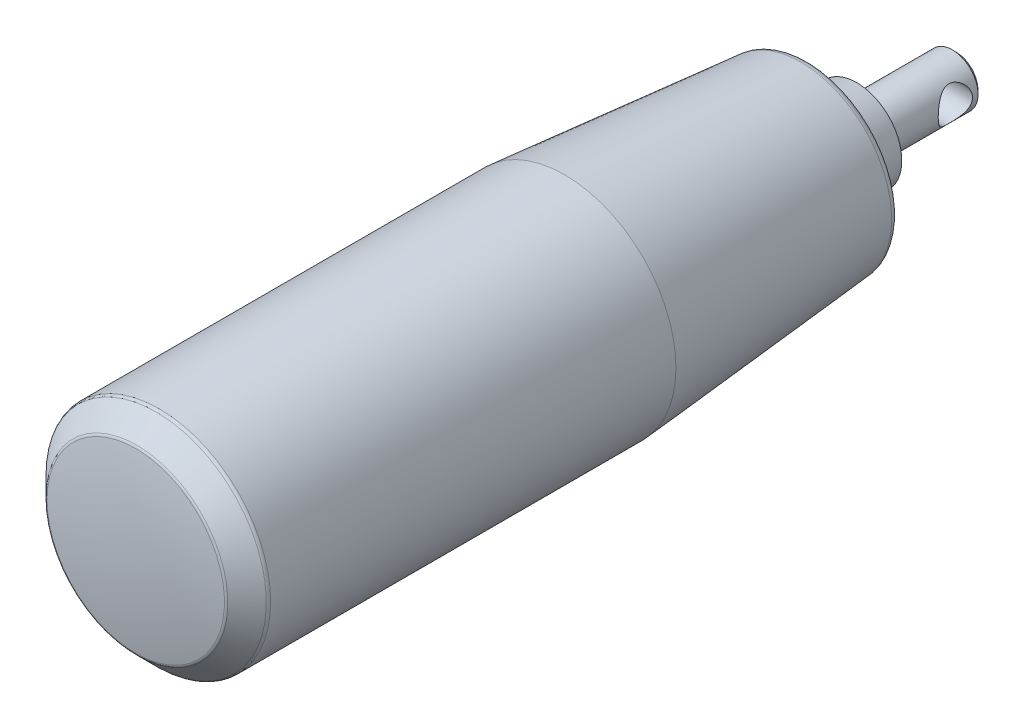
ISO-10303-21;
HEADER;
FILE_DESCRIPTION(('STEP AP214'),'2;1');
FILE_NAME('part.step','',(''),(''),'','','');
FILE_SCHEMA(('AUTOMOTIVE_DESIGN { 1 0 10303 214 1 1 1 1 }'));
ENDSEC;
DATA;
#1=APPLICATION_CONTEXT('core data for automotive mechanical design processes');
#2=APPLICATION_PROTOCOL_DEFINITION('international standard','automotive_design',2000,#1);
#3=PRODUCT_CONTEXT('',#1,'mechanical');
#4=PRODUCT('Part','Part','',(#3));
#5=PRODUCT_RELATED_PRODUCT_CATEGORY('part','',(#4));
#6=PRODUCT_DEFINITION_FORMATION('','',#4);
#7=PRODUCT_DEFINITION_CONTEXT('part definition',#1,'design');
#8=PRODUCT_DEFINITION('design','',#6,#7);
#9=PRODUCT_DEFINITION_SHAPE('','',#8);
#10=(LENGTH_UNIT() NAMED_UNIT(*) SI_UNIT(.MILLI.,.METRE.));
#11=(NAMED_UNIT(*) PLANE_ANGLE_UNIT() SI_UNIT($,.RADIAN.));
#12=(NAMED_UNIT(*) SI_UNIT($,.STERADIAN.) SOLID_ANGLE_UNIT());
#13=UNCERTAINTY_MEASURE_WITH_UNIT(LENGTH_MEASURE(1.E-05),#10,'distance_accuracy_value','');
#14=(GEOMETRIC_REPRESENTATION_CONTEXT(3) GLOBAL_UNCERTAINTY_ASSIGNED_CONTEXT((#13)) GLOBAL_UNIT_ASSIGNED_CONTEXT((#10,
#11,#12)) REPRESENTATION_CONTEXT('',''));
#15=CARTESIAN_POINT('',(0.,0.,0.));
#16=DIRECTION('',(0.,0.,1.));
#17=DIRECTION('',(1.,0.,0.));
#18=AXIS2_PLACEMENT_3D('',#15,#16,#17);
#19=CARTESIAN_POINT('',(0.,0.,37.975000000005));
#20=DIRECTION('',(1.,0.,0.));
#21=DIRECTION('',(0.,0.,-1.));
#22=AXIS2_PLACEMENT_3D('',#19,#20,#21);
#23=SPHERICAL_SURFACE('',#22,55.6249999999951);
#24=CARTESIAN_POINT('',(0.,0.,37.975000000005));
#25=DIRECTION('',(0.,0.,-1.));
#26=DIRECTION('',(-1.,0.,0.));
#27=AXIS2_PLACEMENT_3D('',#24,#25,#26);
#28=SPHERICAL_SURFACE('',#27,55.6249999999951);
#29=CARTESIAN_POINT('',(0.,0.,92.6289551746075));
#30=DIRECTION('',(0.,0.,-1.));
#31=DIRECTION('',(-1.,0.,0.));
#32=AXIS2_PLACEMENT_3D('',#29,#30,#31);
#33=CIRCLE('',#32,10.348227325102);
#34=CARTESIAN_POINT('',(-10.348227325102,0.,92.6289551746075));
#35=VERTEX_POINT('',#34);
#36=EDGE_CURVE('E105',#35,#35,#33,.T.);
#37=ORIENTED_EDGE('',*,*,#36,.F.);
#38=EDGE_LOOP('',(#37));
#39=FACE_BOUND('',#38,.T.);
#40=ADVANCED_FACE('F12',(#39),#28,.T.);
#41=CARTESIAN_POINT('',(0.,0.,0.));
#42=DIRECTION('',(1.,0.,0.));
#43=DIRECTION('',(0.,0.,-1.));
#44=AXIS2_PLACEMENT_3D('',#41,#42,#43);
#45=SPHERICAL_SURFACE('',#44,4.);
#46=CARTESIAN_POINT('',(0.,0.,0.));
#47=DIRECTION('',(0.,0.,-1.));
#48=DIRECTION('',(-1.,0.,0.));
#49=AXIS2_PLACEMENT_3D('',#46,#47,#48);
#50=SPHERICAL_SURFACE('',#49,4.);
#51=CARTESIAN_POINT('',(0.,0.,-2.6457513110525));
#52=DIRECTION('',(0.,0.,-1.));
#53=DIRECTION('',(-1.,0.,0.));
#54=AXIS2_PLACEMENT_3D('',#51,#52,#53);
#55=CIRCLE('',#54,3.00000000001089);
#56=CARTESIAN_POINT('',(-3.00000000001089,0.,-2.6457513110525));
#57=VERTEX_POINT('',#56);
#58=EDGE_CURVE('E8',#57,#57,#55,.T.);
#59=ORIENTED_EDGE('',*,*,#58,.T.);
#60=EDGE_LOOP('',(#59));
#61=FACE_BOUND('',#60,.T.);
#62=ADVANCED_FACE('F93',(#61),#50,.T.);
#63=CARTESIAN_POINT('',(0.,0.,-10.));
#64=DIRECTION('',(0.,0.,-1.));
#65=DIRECTION('',(-1.,0.,0.));
#66=AXIS2_PLACEMENT_3D('',#63,#64,#65);
#67=CYLINDRICAL_SURFACE('',#66,3.00000000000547);
#68=CARTESIAN_POINT('',(-3.00000000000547,0.,2.));
#69=CARTESIAN_POINT('',(-3.00000041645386,0.100484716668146,2.00000054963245));
#70=CARTESIAN_POINT('',(-2.99490802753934,0.200969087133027,1.99238603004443));
#71=CARTESIAN_POINT('',(-2.97504652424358,0.398733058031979,1.96240313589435));
#72=CARTESIAN_POINT('',(-2.96027281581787,0.49601111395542,1.94002775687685));
#73=CARTESIAN_POINT('',(-2.92250482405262,0.684212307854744,1.88189228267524));
#74=CARTESIAN_POINT('',(-2.89954905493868,0.775162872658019,1.84619485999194));
#75=CARTESIAN_POINT('',(-2.84726137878,0.949415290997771,1.76293663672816));
#76=CARTESIAN_POINT('',(-2.81792854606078,1.03271603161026,1.71537411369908));
#77=CARTESIAN_POINT('',(-2.75227329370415,1.19728470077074,1.60534306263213));
#78=CARTESIAN_POINT('',(-2.71556897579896,1.27778030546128,1.5419521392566));
#79=CARTESIAN_POINT('',(-2.63982313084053,1.42772804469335,1.40426995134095));
#80=CARTESIAN_POINT('',(-2.60077830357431,1.49716405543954,1.32996307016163));
#81=CARTESIAN_POINT('',(-2.51728264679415,1.63422297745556,1.15894763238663));
#82=CARTESIAN_POINT('',(-2.47295067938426,1.699831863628,1.0605543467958));
#83=CARTESIAN_POINT('',(-2.39084147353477,1.81350357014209,0.851636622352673));
#84=CARTESIAN_POINT('',(-2.3530529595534,1.86159673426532,0.741133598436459));
#85=CARTESIAN_POINT('',(-2.29976266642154,1.92674035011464,0.543288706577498));
#86=CARTESIAN_POINT('',(-2.28097627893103,1.94874447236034,0.458471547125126));
#87=CARTESIAN_POINT('',(-2.25257969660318,1.98150617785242,0.285255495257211));
#88=CARTESIAN_POINT('',(-2.24295368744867,1.99228314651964,0.196863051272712));
#89=CARTESIAN_POINT('',(-2.23436605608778,2.0019136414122,0.0185252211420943));
#90=CARTESIAN_POINT('',(-2.23544802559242,2.0007184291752,-0.0714250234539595));
#91=CARTESIAN_POINT('',(-2.24819775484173,1.98637581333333,-0.249634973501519));
#92=CARTESIAN_POINT('',(-2.25987448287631,1.97321828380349,-0.33789318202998));
#93=CARTESIAN_POINT('',(-2.29127185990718,1.93664994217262,-0.506467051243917));
#94=CARTESIAN_POINT('',(-2.31061488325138,1.91371711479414,-0.586961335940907));
#95=CARTESIAN_POINT('',(-2.35509622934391,1.85870118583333,-0.743023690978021));
#96=CARTESIAN_POINT('',(-2.38023645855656,1.8266150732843,-0.818590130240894));
#97=CARTESIAN_POINT('',(-2.43964196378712,1.74673818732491,-0.979025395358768));
#98=CARTESIAN_POINT('',(-2.47472317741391,1.69708052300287,-1.06265990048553));
#99=CARTESIAN_POINT('',(-2.54691537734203,1.58668960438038,-1.22138339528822));
#100=CARTESIAN_POINT('',(-2.58402882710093,1.52594268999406,-1.29646165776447));
#101=CARTESIAN_POINT('',(-2.66543343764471,1.37981165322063,-1.45254254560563));
#102=CARTESIAN_POINT('',(-2.70954744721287,1.29193938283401,-1.53133404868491));
#103=CARTESIAN_POINT('',(-2.7921810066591,1.10200799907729,-1.67319649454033));
#104=CARTESIAN_POINT('',(-2.83070577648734,0.999962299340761,-1.73628214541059));
#105=CARTESIAN_POINT('',(-2.89145404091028,0.804857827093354,-1.83347771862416));
#106=CARTESIAN_POINT('',(-2.91539261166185,0.713957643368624,-1.87084336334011));
#107=CARTESIAN_POINT('',(-2.95507719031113,0.526036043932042,-1.93210492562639));
#108=CARTESIAN_POINT('',(-2.97083012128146,0.429019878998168,-1.95601222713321));
#109=CARTESIAN_POINT('',(-2.99275882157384,0.230985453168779,-1.98916116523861));
#110=CARTESIAN_POINT('',(-2.99889322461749,0.129951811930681,-1.99833946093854));
#111=CARTESIAN_POINT('',(-3.00083114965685,-0.0724415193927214,-2.00124708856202));
#112=CARTESIAN_POINT('',(-2.99663539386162,-0.173801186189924,-1.99497750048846));
#113=CARTESIAN_POINT('',(-2.97899589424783,-0.366455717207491,-1.96837594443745));
#114=CARTESIAN_POINT('',(-2.96622246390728,-0.457957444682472,-1.949062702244));
#115=CARTESIAN_POINT('',(-2.93318449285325,-0.63611639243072,-1.89840431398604));
#116=CARTESIAN_POINT('',(-2.91291875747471,-0.722772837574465,-1.86705724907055));
#117=CARTESIAN_POINT('',(-2.86496352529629,-0.894664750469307,-1.79134770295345));
#118=CARTESIAN_POINT('',(-2.8368987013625,-0.97949618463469,-1.74631184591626));
#119=CARTESIAN_POINT('',(-2.77601855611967,-1.14068302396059,-1.6455667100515));
#120=CARTESIAN_POINT('',(-2.74320030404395,-1.21703314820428,-1.58985083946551));
#121=CARTESIAN_POINT('',(-2.66954546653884,-1.3718544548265,-1.45939213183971));
#122=CARTESIAN_POINT('',(-2.62826156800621,-1.44875187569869,-1.38303373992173));
#123=CARTESIAN_POINT('',(-2.54571173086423,-1.58933968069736,-1.21888857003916));
#124=CARTESIAN_POINT('',(-2.50444582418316,-1.65302093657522,-1.13109396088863));
#125=CARTESIAN_POINT('',(-2.42939678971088,-1.76124776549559,-0.95285758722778));
#126=CARTESIAN_POINT('',(-2.39527597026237,-1.80695636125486,-0.863267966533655));
#127=CARTESIAN_POINT('',(-2.33438974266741,-1.88496213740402,-0.676127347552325));
#128=CARTESIAN_POINT('',(-2.30761112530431,-1.91728345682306,-0.578591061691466));
#129=CARTESIAN_POINT('',(-2.26933208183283,-1.96235843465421,-0.395435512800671));
#130=CARTESIAN_POINT('',(-2.25594998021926,-1.97758597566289,-0.310828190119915));
#131=CARTESIAN_POINT('',(-2.23879466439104,-1.99699205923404,-0.139426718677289));
#132=CARTESIAN_POINT('',(-2.2350110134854,-2.00118260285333,-0.0526350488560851));
#133=CARTESIAN_POINT('',(-2.23764201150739,-1.99823921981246,0.120643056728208));
#134=CARTESIAN_POINT('',(-2.24406269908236,-1.99109858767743,0.207129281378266));
#135=CARTESIAN_POINT('',(-2.2661045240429,-1.96596997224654,0.377343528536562));
#136=CARTESIAN_POINT('',(-2.28173793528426,-1.94796751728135,0.461067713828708));
#137=CARTESIAN_POINT('',(-2.32526843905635,-1.89593035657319,0.645711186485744));
#138=CARTESIAN_POINT('',(-2.35532333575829,-1.85890187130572,0.745267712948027));
#139=CARTESIAN_POINT('',(-2.42222161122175,-1.77084526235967,0.935486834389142));
#140=CARTESIAN_POINT('',(-2.45907449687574,-1.71979748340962,1.02613669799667));
#141=CARTESIAN_POINT('',(-2.53617186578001,-1.60398280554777,1.19928188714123));
#142=CARTESIAN_POINT('',(-2.57646587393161,-1.5389830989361,1.28159874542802));
#143=CARTESIAN_POINT('',(-2.65628301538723,-1.39671768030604,1.4353224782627));
#144=CARTESIAN_POINT('',(-2.69580590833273,-1.31944821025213,1.5067259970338));
#145=CARTESIAN_POINT('',(-2.77631551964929,-1.14145732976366,1.6467121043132));
#146=CARTESIAN_POINT('',(-2.8166980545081,-1.03896166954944,1.71341864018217));
#147=CARTESIAN_POINT('',(-2.8877766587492,-0.820868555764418,1.82791327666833));
#148=CARTESIAN_POINT('',(-2.91848793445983,-0.7052920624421,1.87573110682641));
#149=CARTESIAN_POINT('',(-2.96101644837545,-0.491435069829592,1.94115457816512));
#150=CARTESIAN_POINT('',(-2.97551480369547,-0.395012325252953,1.96311103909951));
#151=CARTESIAN_POINT('',(-2.99500280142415,-0.19905801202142,1.99252803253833));
#152=CARTESIAN_POINT('',(-2.99999958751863,-0.0995288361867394,1.99999945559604));
#153=CARTESIAN_POINT('',(-3.00000000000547,0.,2.));
#154=B_SPLINE_CURVE_WITH_KNOTS('',3,(#68,#69,#70,#71,#72,#73,#74,#75,#76,#77,#78,#79,#80,#81,
#82,#83,#84,#85,#86,#87,#88,#89,#90,#91,#92,#93,#94,#95,#96,#97,#98,#99,#100,#101,#102,#103,
#104,#105,#106,#107,#108,#109,#110,#111,#112,#113,#114,#115,#116,#117,#118,#119,#120,#121,#122,
#123,#124,#125,#126,#127,#128,#129,#130,#131,#132,#133,#134,#135,#136,#137,#138,#139,#140,#141,
#142,#143,#144,#145,#146,#147,#148,#149,#150,#151,#152,#153),.UNSPECIFIED.,.T.,.F.,(4,2,2,2,2,2,
2,2,2,2,2,2,2,2,2,2,2,2,2,2,2,2,2,2,2,2,2,2,2,2,2,2,2,2,2,2,2,2,2,2,2,2,4),(0.,
0.301053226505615,0.602249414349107,0.902046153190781,1.20188643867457,1.52717029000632,
1.85292411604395,2.23006683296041,2.60655305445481,2.87433693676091,3.14165767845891,
3.41006711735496,3.67870397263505,3.93548862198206,4.19235783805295,4.50147574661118,
4.81097703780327,5.18718954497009,5.56304840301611,5.86524087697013,6.1671773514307,
6.47040883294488,6.77361911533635,7.05553084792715,7.33748755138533,7.6365234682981,
7.9357445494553,8.28228176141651,8.6290575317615,8.94649935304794,9.2633662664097,
9.52324048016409,9.78283200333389,10.0425772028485,10.3026692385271,10.6320660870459,
10.9619271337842,11.2977924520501,11.6337608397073,12.017953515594,12.4015390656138,
12.6999529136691,12.9981423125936),.UNSPECIFIED.);
#155=CARTESIAN_POINT('',(-3.00000000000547,0.,2.));
#156=VERTEX_POINT('',#155);
#157=EDGE_CURVE('E15',#156,#156,#154,.T.);
#158=ORIENTED_EDGE('',*,*,#157,.F.);
#159=EDGE_LOOP('',(#158));
#160=FACE_BOUND('',#159,.T.);
#161=CARTESIAN_POINT('',(3.00000000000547,0.,-2.));
#162=CARTESIAN_POINT('',(3.00000041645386,0.100484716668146,-2.00000054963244));
#163=CARTESIAN_POINT('',(2.99490802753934,0.200969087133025,-1.99238603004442));
#164=CARTESIAN_POINT('',(2.97504652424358,0.398733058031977,-1.96240313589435));
#165=CARTESIAN_POINT('',(2.96027281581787,0.49601111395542,-1.94002775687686));
#166=CARTESIAN_POINT('',(2.92250482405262,0.684212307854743,-1.88189228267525));
#167=CARTESIAN_POINT('',(2.89954905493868,0.775162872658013,-1.84619485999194));
#168=CARTESIAN_POINT('',(2.84726137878,0.949415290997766,-1.76293663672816));
#169=CARTESIAN_POINT('',(2.81792854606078,1.03271603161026,-1.7153741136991));
#170=CARTESIAN_POINT('',(2.75227329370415,1.19728470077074,-1.60534306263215));
#171=CARTESIAN_POINT('',(2.71556897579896,1.27778030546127,-1.54195213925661));
#172=CARTESIAN_POINT('',(2.63982313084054,1.42772804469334,-1.40426995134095));
#173=CARTESIAN_POINT('',(2.60077830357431,1.49716405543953,-1.32996307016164));
#174=CARTESIAN_POINT('',(2.51728264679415,1.63422297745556,-1.15894763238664));
#175=CARTESIAN_POINT('',(2.47295067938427,1.69983186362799,-1.06055434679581));
#176=CARTESIAN_POINT('',(2.39084147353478,1.81350357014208,-0.851636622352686));
#177=CARTESIAN_POINT('',(2.3530529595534,1.86159673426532,-0.741133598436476));
#178=CARTESIAN_POINT('',(2.29976266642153,1.92674035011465,-0.543288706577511));
#179=CARTESIAN_POINT('',(2.28097627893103,1.94874447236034,-0.458471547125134));
#180=CARTESIAN_POINT('',(2.25257969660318,1.98150617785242,-0.285255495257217));
#181=CARTESIAN_POINT('',(2.24295368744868,1.99228314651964,-0.196863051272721));
#182=CARTESIAN_POINT('',(2.23436605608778,2.0019136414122,-0.018525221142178));
#183=CARTESIAN_POINT('',(2.23544802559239,2.00071842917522,0.0714250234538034));
#184=CARTESIAN_POINT('',(2.24819775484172,1.98637581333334,0.249634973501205));
#185=CARTESIAN_POINT('',(2.25987448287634,1.97321828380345,0.337893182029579));
#186=CARTESIAN_POINT('',(2.29127185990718,1.93664994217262,0.506467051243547));
#187=CARTESIAN_POINT('',(2.31061488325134,1.9137171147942,0.586961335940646));
#188=CARTESIAN_POINT('',(2.35509622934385,1.8587011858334,0.743023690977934));
#189=CARTESIAN_POINT('',(2.38023645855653,1.82661507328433,0.818590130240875));
#190=CARTESIAN_POINT('',(2.43964196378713,1.74673818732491,0.979025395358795));
#191=CARTESIAN_POINT('',(2.47472317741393,1.69708052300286,1.06265990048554));
#192=CARTESIAN_POINT('',(2.54691537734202,1.58668960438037,1.22138339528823));
#193=CARTESIAN_POINT('',(2.5840288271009,1.52594268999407,1.2964616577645));
#194=CARTESIAN_POINT('',(2.66543343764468,1.37981165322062,1.45254254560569));
#195=CARTESIAN_POINT('',(2.70954744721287,1.29193938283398,1.53133404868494));
#196=CARTESIAN_POINT('',(2.79218100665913,1.10200799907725,1.67319649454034));
#197=CARTESIAN_POINT('',(2.83070577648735,0.999962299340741,1.73628214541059));
#198=CARTESIAN_POINT('',(2.89145404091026,0.804857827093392,1.83347771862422));
#199=CARTESIAN_POINT('',(2.91539261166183,0.713957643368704,1.87084336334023));
#200=CARTESIAN_POINT('',(2.95507719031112,0.526036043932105,1.93210492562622));
#201=CARTESIAN_POINT('',(2.97083012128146,0.429019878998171,1.9560122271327));
#202=CARTESIAN_POINT('',(2.99275882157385,0.230985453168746,1.98916116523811));
#203=CARTESIAN_POINT('',(2.99889322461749,0.129951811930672,1.9983394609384));
#204=CARTESIAN_POINT('',(3.00083114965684,-0.0724415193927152,2.00124708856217));
#205=CARTESIAN_POINT('',(2.99663539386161,-0.173801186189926,1.99497750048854));
#206=CARTESIAN_POINT('',(2.97899589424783,-0.366455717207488,1.96837594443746));
#207=CARTESIAN_POINT('',(2.96622246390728,-0.457957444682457,1.94906270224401));
#208=CARTESIAN_POINT('',(2.93318449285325,-0.636116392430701,1.89840431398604));
#209=CARTESIAN_POINT('',(2.9129187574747,-0.722772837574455,1.86705724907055));
#210=CARTESIAN_POINT('',(2.86496352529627,-0.894664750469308,1.79134770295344));
#211=CARTESIAN_POINT('',(2.83689870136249,-0.979496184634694,1.74631184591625));
#212=CARTESIAN_POINT('',(2.77601855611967,-1.1406830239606,1.64556671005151));
#213=CARTESIAN_POINT('',(2.74320030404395,-1.21703314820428,1.58985083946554));
#214=CARTESIAN_POINT('',(2.66954546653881,-1.37185445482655,1.45939213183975));
#215=CARTESIAN_POINT('',(2.62826156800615,-1.44875187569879,1.38303373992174));
#216=CARTESIAN_POINT('',(2.54571173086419,-1.58933968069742,1.21888857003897));
#217=CARTESIAN_POINT('',(2.50444582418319,-1.65302093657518,1.13109396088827));
#218=CARTESIAN_POINT('',(2.42939678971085,-1.76124776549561,0.952857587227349));
#219=CARTESIAN_POINT('',(2.39527597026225,-1.80695636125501,0.863267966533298));
#220=CARTESIAN_POINT('',(2.33438974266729,-1.88496213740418,0.676127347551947));
#221=CARTESIAN_POINT('',(2.30761112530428,-1.91728345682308,0.578591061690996));
#222=CARTESIAN_POINT('',(2.26933208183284,-1.96235843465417,0.395435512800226));
#223=CARTESIAN_POINT('',(2.25594998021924,-1.97758597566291,0.310828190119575));
#224=CARTESIAN_POINT('',(2.23879466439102,-1.99699205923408,0.139426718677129));
#225=CARTESIAN_POINT('',(2.2350110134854,-2.00118260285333,0.0526350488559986));
#226=CARTESIAN_POINT('',(2.23764201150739,-1.99823921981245,-0.120643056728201));
#227=CARTESIAN_POINT('',(2.24406269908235,-1.99109858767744,-0.207129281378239));
#228=CARTESIAN_POINT('',(2.26610452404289,-1.96596997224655,-0.377343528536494));
#229=CARTESIAN_POINT('',(2.28173793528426,-1.94796751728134,-0.461067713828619));
#230=CARTESIAN_POINT('',(2.32526843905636,-1.89593035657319,-0.645711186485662));
#231=CARTESIAN_POINT('',(2.35532333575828,-1.85890187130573,-0.745267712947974));
#232=CARTESIAN_POINT('',(2.42222161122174,-1.77084526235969,-0.935486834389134));
#233=CARTESIAN_POINT('',(2.45907449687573,-1.71979748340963,-1.02613669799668));
#234=CARTESIAN_POINT('',(2.53617186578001,-1.60398280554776,-1.19928188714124));
#235=CARTESIAN_POINT('',(2.57646587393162,-1.53898309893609,-1.28159874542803));
#236=CARTESIAN_POINT('',(2.65628301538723,-1.39671768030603,-1.4353224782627));
#237=CARTESIAN_POINT('',(2.69580590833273,-1.31944821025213,-1.50672599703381));
#238=CARTESIAN_POINT('',(2.77631551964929,-1.14145732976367,-1.64671210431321));
#239=CARTESIAN_POINT('',(2.81669805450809,-1.03896166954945,-1.71341864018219));
#240=CARTESIAN_POINT('',(2.8877766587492,-0.820868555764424,-1.82791327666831));
#241=CARTESIAN_POINT('',(2.91848793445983,-0.705292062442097,-1.87573110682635));
#242=CARTESIAN_POINT('',(2.96101644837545,-0.49143506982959,-1.94115457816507));
#243=CARTESIAN_POINT('',(2.97551480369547,-0.395012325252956,-1.96311103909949));
#244=CARTESIAN_POINT('',(2.99500280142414,-0.199058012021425,-1.99252803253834));
#245=CARTESIAN_POINT('',(2.99999958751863,-0.099528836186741,-1.99999945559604));
#246=CARTESIAN_POINT('',(3.00000000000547,0.,-2.));
#247=B_SPLINE_CURVE_WITH_KNOTS('',3,(#161,#162,#163,#164,#165,#166,#167,#168,#169,#170,#171,
#172,#173,#174,#175,#176,#177,#178,#179,#180,#181,#182,#183,#184,#185,#186,#187,#188,#189,#190,
#191,#192,#193,#194,#195,#196,#197,#198,#199,#200,#201,#202,#203,#204,#205,#206,#207,#208,#209,
#210,#211,#212,#213,#214,#215,#216,#217,#218,#219,#220,#221,#222,#223,#224,#225,#226,#227,#228,
#229,#230,#231,#232,#233,#234,#235,#236,#237,#238,#239,#240,#241,#242,#243,#244,#245,#246),
.UNSPECIFIED.,.T.,.F.,(4,2,2,2,2,2,2,2,2,2,2,2,2,2,2,2,2,2,2,2,2,2,2,2,2,2,2,2,2,2,2,2,2,2,2,2,
2,2,2,2,2,2,4),(0.,0.301053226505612,0.602249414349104,0.902046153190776,1.20188643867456,
1.52717029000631,1.85292411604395,2.2300668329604,2.6065530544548,2.87433693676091,
3.1416576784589,3.41006711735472,3.6787039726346,3.93548862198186,4.19235783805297,
4.50147574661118,4.81097703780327,5.18718954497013,5.56304840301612,5.86524087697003,
6.16717735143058,6.47040883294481,6.77361911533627,7.05553084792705,7.33748755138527,
7.63652346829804,7.93574454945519,8.28228176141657,8.62905753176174,8.94649935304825,
9.26336626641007,9.52324048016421,9.78283200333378,10.0425772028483,10.3026692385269,
10.6320660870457,10.9619271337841,11.29779245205,11.6337608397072,12.0179535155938,
12.4015390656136,12.699952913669,12.9981423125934),.UNSPECIFIED.);
#248=CARTESIAN_POINT('',(3.00000000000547,0.,-2.));
#249=VERTEX_POINT('',#248);
#250=EDGE_CURVE('E32',#249,#249,#247,.T.);
#251=ORIENTED_EDGE('',*,*,#250,.F.);
#252=EDGE_LOOP('',(#251));
#253=FACE_BOUND('',#252,.T.);
#254=CARTESIAN_POINT('',(0.,0.,8.5));
#255=DIRECTION('',(0.,0.,-1.));
#256=DIRECTION('',(-1.,0.,0.));
#257=AXIS2_PLACEMENT_3D('',#254,#255,#256);
#258=CIRCLE('',#257,3.00000000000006);
#259=CARTESIAN_POINT('',(-3.00000000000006,0.,8.5));
#260=VERTEX_POINT('',#259);
#261=EDGE_CURVE('E24',#260,#260,#258,.T.);
#262=ORIENTED_EDGE('',*,*,#261,.T.);
#263=EDGE_LOOP('',(#262));
#264=FACE_BOUND('',#263,.T.);
#265=ORIENTED_EDGE('',*,*,#58,.F.);
#266=EDGE_LOOP('',(#265));
#267=FACE_BOUND('',#266,.T.);
#268=ADVANCED_FACE('F37',(#160,#253,#264,#267),#67,.T.);
#269=CARTESIAN_POINT('',(0.,3.,8.5));
#270=DIRECTION('',(0.,0.,-1.));
#271=DIRECTION('',(-1.,0.,0.));
#272=AXIS2_PLACEMENT_3D('',#269,#270,#271);
#273=PLANE('',#272);
#274=CARTESIAN_POINT('',(0.,0.,8.5));
#275=DIRECTION('',(0.,0.,-1.));
#276=DIRECTION('',(-1.,0.,0.));
#277=AXIS2_PLACEMENT_3D('',#274,#275,#276);
#278=CIRCLE('',#277,5.25);
#279=CARTESIAN_POINT('',(-5.25,0.,8.5));
#280=VERTEX_POINT('',#279);
#281=EDGE_CURVE('E29',#280,#280,#278,.T.);
#282=ORIENTED_EDGE('',*,*,#281,.T.);
#283=EDGE_LOOP('',(#282));
#284=FACE_BOUND('',#283,.T.);
#285=ORIENTED_EDGE('',*,*,#261,.F.);
#286=EDGE_LOOP('',(#285));
#287=FACE_BOUND('',#286,.T.);
#288=ADVANCED_FACE('F84',(#284,#287),#273,.T.);
#289=CARTESIAN_POINT('',(0.,0.,13.6));
#290=DIRECTION('',(0.,0.,1.));
#291=DIRECTION('',(1.,0.,0.));
#292=AXIS2_PLACEMENT_3D('',#289,#290,#291);
#293=CONICAL_SURFACE('',#292,6.,0.146012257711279);
#294=ORIENTED_EDGE('',*,*,#281,.F.);
#295=EDGE_LOOP('',(#294));
#296=FACE_BOUND('',#295,.T.);
#297=CARTESIAN_POINT('',(0.,0.,13.6));
#298=DIRECTION('',(0.,0.,-1.));
#299=DIRECTION('',(-1.,0.,0.));
#300=AXIS2_PLACEMENT_3D('',#297,#298,#299);
#301=CIRCLE('',#300,6.);
#302=CARTESIAN_POINT('',(-6.,0.,13.6));
#303=VERTEX_POINT('',#302);
#304=EDGE_CURVE('E133',#303,#303,#301,.T.);
#305=ORIENTED_EDGE('',*,*,#304,.T.);
#306=EDGE_LOOP('',(#305));
#307=FACE_BOUND('',#306,.T.);
#308=ADVANCED_FACE('F81',(#296,#307),#293,.T.);
#309=CARTESIAN_POINT('',(0.,7.,13.6));
#310=DIRECTION('',(0.,0.,1.));
#311=DIRECTION('',(1.,0.,0.));
#312=AXIS2_PLACEMENT_3D('',#309,#310,#311);
#313=PLANE('',#312);
#314=ORIENTED_EDGE('',*,*,#304,.F.);
#315=EDGE_LOOP('',(#314));
#316=FACE_BOUND('',#315,.T.);
#317=CARTESIAN_POINT('',(0.,0.,13.6));
#318=DIRECTION('',(0.,0.,-1.));
#319=DIRECTION('',(-1.,0.,0.));
#320=AXIS2_PLACEMENT_3D('',#317,#318,#319);
#321=CIRCLE('',#320,7.);
#322=CARTESIAN_POINT('',(-7.,0.,13.6));
#323=VERTEX_POINT('',#322);
#324=EDGE_CURVE('E130',#323,#323,#321,.T.);
#325=ORIENTED_EDGE('',*,*,#324,.T.);
#326=EDGE_LOOP('',(#325));
#327=FACE_BOUND('',#326,.T.);
#328=ADVANCED_FACE('F77',(#316,#327),#313,.F.);
#329=CARTESIAN_POINT('',(0.,0.,-10.));
#330=DIRECTION('',(0.,0.,-1.));
#331=DIRECTION('',(-1.,0.,0.));
#332=AXIS2_PLACEMENT_3D('',#329,#330,#331);
#333=CYLINDRICAL_SURFACE('',#332,7.);
#334=CARTESIAN_POINT('',(0.,0.,14.1));
#335=DIRECTION('',(0.,0.,-1.));
#336=DIRECTION('',(-1.,0.,0.));
#337=AXIS2_PLACEMENT_3D('',#334,#335,#336);
#338=CIRCLE('',#337,7.);
#339=CARTESIAN_POINT('',(-7.,0.,14.1));
#340=VERTEX_POINT('',#339);
#341=EDGE_CURVE('E127',#340,#340,#338,.T.);
#342=ORIENTED_EDGE('',*,*,#341,.T.);
#343=EDGE_LOOP('',(#342));
#344=FACE_BOUND('',#343,.T.);
#345=ORIENTED_EDGE('',*,*,#324,.F.);
#346=EDGE_LOOP('',(#345));
#347=FACE_BOUND('',#346,.T.);
#348=ADVANCED_FACE('F73',(#344,#347),#333,.T.);
#349=CARTESIAN_POINT('',(0.,9.58387933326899,14.1));
#350=DIRECTION('',(0.,0.,1.));
#351=DIRECTION('',(1.,0.,0.));
#352=AXIS2_PLACEMENT_3D('',#349,#350,#351);
#353=PLANE('',#352);
#354=ORIENTED_EDGE('',*,*,#341,.F.);
#355=EDGE_LOOP('',(#354));
#356=FACE_BOUND('',#355,.T.);
#357=CARTESIAN_POINT('',(0.,0.,14.1));
#358=DIRECTION('',(0.,0.,-1.));
#359=DIRECTION('',(-1.,0.,0.));
#360=AXIS2_PLACEMENT_3D('',#357,#358,#359);
#361=CIRCLE('',#360,9.58387933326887);
#362=CARTESIAN_POINT('',(-9.58387933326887,0.,14.1));
#363=VERTEX_POINT('',#362);
#364=EDGE_CURVE('E124',#363,#363,#361,.T.);
#365=ORIENTED_EDGE('',*,*,#364,.T.);
#366=EDGE_LOOP('',(#365));
#367=FACE_BOUND('',#366,.T.);
#368=ADVANCED_FACE('F69',(#356,#367),#353,.F.);
#369=CARTESIAN_POINT('',(0.,0.,15.1));
#370=DIRECTION('',(0.,0.,-1.));
#371=DIRECTION('',(-1.,0.,0.));
#372=AXIS2_PLACEMENT_3D('',#369,#370,#371);
#373=TOROIDAL_SURFACE('',#372,9.58387933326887,1.00000000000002);
#374=CARTESIAN_POINT('',(0.,0.,15.012616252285));
#375=DIRECTION('',(0.,0.,-1.));
#376=DIRECTION('',(-1.,0.,0.));
#377=AXIS2_PLACEMENT_3D('',#374,#375,#376);
#378=CIRCLE('',#377,10.5800540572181);
#379=CARTESIAN_POINT('',(-10.5800540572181,0.,15.012616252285));
#380=VERTEX_POINT('',#379);
#381=EDGE_CURVE('E121',#380,#380,#378,.T.);
#382=ORIENTED_EDGE('',*,*,#381,.T.);
#383=EDGE_LOOP('',(#382));
#384=FACE_BOUND('',#383,.T.);
#385=ORIENTED_EDGE('',*,*,#364,.F.);
#386=EDGE_LOOP('',(#385));
#387=FACE_BOUND('',#386,.T.);
#388=ADVANCED_FACE('F65',(#384,#387),#373,.T.);
#389=CARTESIAN_POINT('',(0.,0.,42.6));
#390=DIRECTION('',(0.,0.,1.));
#391=DIRECTION('',(1.,0.,0.));
#392=AXIS2_PLACEMENT_3D('',#389,#390,#391);
#393=CONICAL_SURFACE('',#392,13.,0.0874953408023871);
#394=ORIENTED_EDGE('',*,*,#381,.F.);
#395=EDGE_LOOP('',(#394));
#396=FACE_BOUND('',#395,.T.);
#397=CARTESIAN_POINT('',(0.,0.,42.6));
#398=DIRECTION('',(0.,0.,-1.));
#399=DIRECTION('',(-1.,0.,0.));
#400=AXIS2_PLACEMENT_3D('',#397,#398,#399);
#401=CIRCLE('',#400,13.);
#402=CARTESIAN_POINT('',(-13.,0.,42.6));
#403=VERTEX_POINT('',#402);
#404=EDGE_CURVE('E118',#403,#403,#401,.T.);
#405=ORIENTED_EDGE('',*,*,#404,.T.);
#406=EDGE_LOOP('',(#405));
#407=FACE_BOUND('',#406,.T.);
#408=ADVANCED_FACE('F61',(#396,#407),#393,.T.);
#409=CARTESIAN_POINT('',(0.,0.,-10.));
#410=DIRECTION('',(0.,0.,-1.));
#411=DIRECTION('',(-1.,0.,0.));
#412=AXIS2_PLACEMENT_3D('',#409,#410,#411);
#413=CYLINDRICAL_SURFACE('',#412,13.);
#414=CARTESIAN_POINT('',(0.,0.,89.8928932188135));
#415=DIRECTION('',(0.,0.,-1.));
#416=DIRECTION('',(-1.,0.,0.));
#417=AXIS2_PLACEMENT_3D('',#414,#415,#416);
#418=CIRCLE('',#417,13.);
#419=CARTESIAN_POINT('',(-13.,0.,89.8928932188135));
#420=VERTEX_POINT('',#419);
#421=EDGE_CURVE('E115',#420,#420,#418,.T.);
#422=ORIENTED_EDGE('',*,*,#421,.T.);
#423=EDGE_LOOP('',(#422));
#424=FACE_BOUND('',#423,.T.);
#425=ORIENTED_EDGE('',*,*,#404,.F.);
#426=EDGE_LOOP('',(#425));
#427=FACE_BOUND('',#426,.T.);
#428=ADVANCED_FACE('F57',(#424,#427),#413,.T.);
#429=CARTESIAN_POINT('',(0.,0.,89.8928932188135));
#430=DIRECTION('',(0.,0.,-1.));
#431=DIRECTION('',(-1.,0.,0.));
#432=AXIS2_PLACEMENT_3D('',#429,#430,#431);
#433=TOROIDAL_SURFACE('',#432,12.5,0.500000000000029);
#434=CARTESIAN_POINT('',(0.,0.,90.2464466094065));
#435=DIRECTION('',(0.,0.,-1.));
#436=DIRECTION('',(-1.,0.,0.));
#437=AXIS2_PLACEMENT_3D('',#434,#435,#436);
#438=CIRCLE('',#437,12.8535533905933);
#439=CARTESIAN_POINT('',(-12.8535533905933,0.,90.2464466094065));
#440=VERTEX_POINT('',#439);
#441=EDGE_CURVE('E109',#440,#440,#438,.T.);
#442=ORIENTED_EDGE('',*,*,#441,.T.);
#443=EDGE_LOOP('',(#442));
#444=FACE_BOUND('',#443,.T.);
#445=ORIENTED_EDGE('',*,*,#421,.F.);
#446=EDGE_LOOP('',(#445));
#447=FACE_BOUND('',#446,.T.);
#448=ADVANCED_FACE('F53',(#444,#447),#433,.T.);
#449=CARTESIAN_POINT('',(0.,0.,92.4912370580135));
#450=DIRECTION('',(0.,0.,-1.));
#451=DIRECTION('',(-1.,0.,0.));
#452=AXIS2_PLACEMENT_3D('',#449,#450,#451);
#453=CONICAL_SURFACE('',#452,10.6087629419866,0.785398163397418);
#454=ORIENTED_EDGE('',*,*,#441,.F.);
#455=EDGE_LOOP('',(#454));
#456=FACE_BOUND('',#455,.T.);
#457=CARTESIAN_POINT('',(0.,0.,92.4912370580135));
#458=DIRECTION('',(0.,0.,-1.));
#459=DIRECTION('',(-1.,0.,0.));
#460=AXIS2_PLACEMENT_3D('',#457,#458,#459);
#461=CIRCLE('',#460,10.6087629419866);
#462=CARTESIAN_POINT('',(-10.6087629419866,0.,92.4912370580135));
#463=VERTEX_POINT('',#462);
#464=EDGE_CURVE('E106',#463,#463,#461,.T.);
#465=ORIENTED_EDGE('',*,*,#464,.T.);
#466=EDGE_LOOP('',(#465));
#467=FACE_BOUND('',#466,.T.);
#468=ADVANCED_FACE('F49',(#456,#467),#453,.T.);
#469=CARTESIAN_POINT('',(0.,0.,92.13768366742));
#470=DIRECTION('',(0.,0.,-1.));
#471=DIRECTION('',(-1.,0.,0.));
#472=AXIS2_PLACEMENT_3D('',#469,#470,#471);
#473=TOROIDAL_SURFACE('',#472,10.2552095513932,0.5);
#474=ORIENTED_EDGE('',*,*,#36,.T.);
#475=EDGE_LOOP('',(#474));
#476=FACE_BOUND('',#475,.T.);
#477=ORIENTED_EDGE('',*,*,#464,.F.);
#478=EDGE_LOOP('',(#477));
#479=FACE_BOUND('',#478,.T.);
#480=ADVANCED_FACE('F44',(#476,#479),#473,.T.);
#481=CARTESIAN_POINT('',(-13.,0.,0.));
#482=DIRECTION('',(1.,0.,0.));
#483=DIRECTION('',(0.,0.,-1.));
#484=AXIS2_PLACEMENT_3D('',#481,#482,#483);
#485=CYLINDRICAL_SURFACE('',#484,2.);
#486=ORIENTED_EDGE('',*,*,#157,.T.);
#487=EDGE_LOOP('',(#486));
#488=FACE_BOUND('',#487,.T.);
#489=ORIENTED_EDGE('',*,*,#250,.T.);
#490=EDGE_LOOP('',(#489));
#491=FACE_BOUND('',#490,.T.);
#492=ADVANCED_FACE('F40',(#488,#491),#485,.F.);
#493=CLOSED_SHELL('',(#40,#62,#268,#288,#308,#328,#348,#368,#388,#408,#428,#448,#468,#480,#492));
#494=MANIFOLD_SOLID_BREP('B1',#493);
#495=ADVANCED_BREP_SHAPE_REPRESENTATION('',(#18,#494),#14);
#496=SHAPE_DEFINITION_REPRESENTATION(#9,#495);
ENDSEC;
END-ISO-10303-21;
